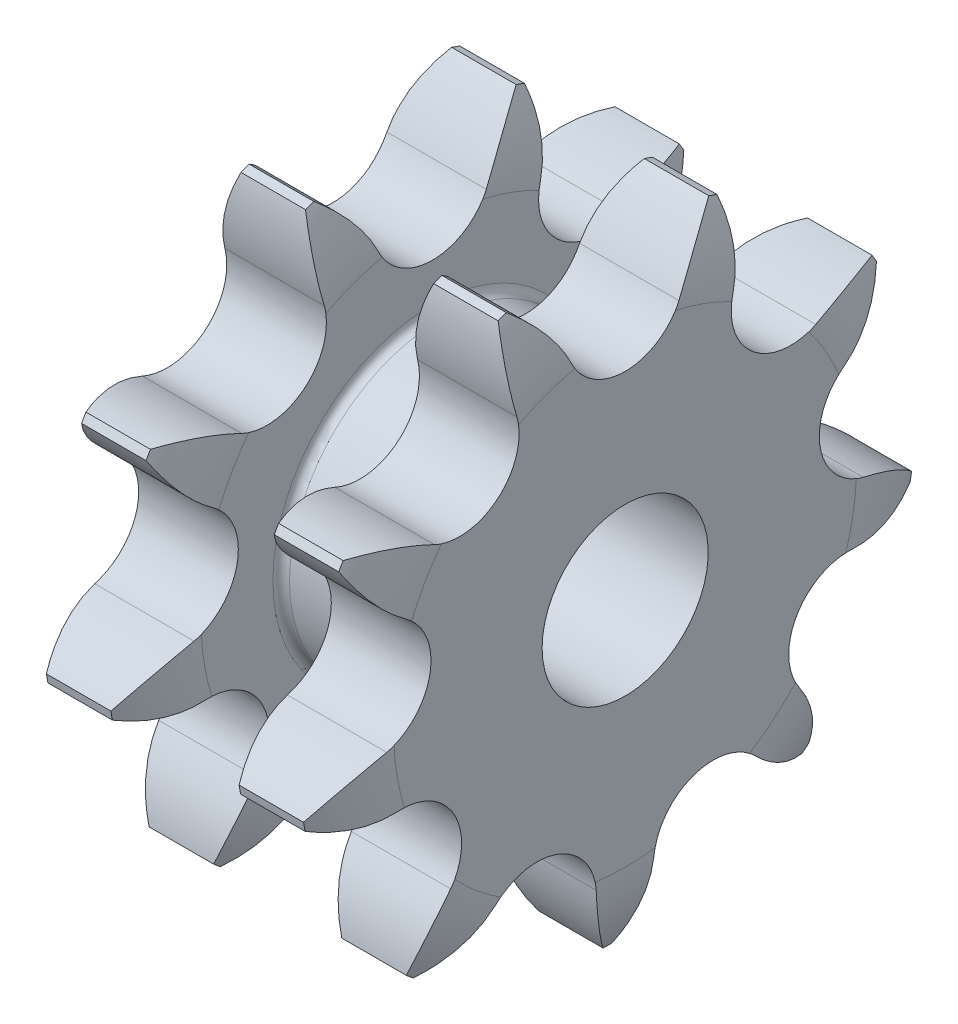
from build123d import *

# Parameters (mm, degrees)
TOOTHCUT_DEPTH  = 38.895381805
TEETHCUTS_COUNT = 9
TEETHCUTS_ANGLE = 320
BORSKE_R        = 6
BORE_DEPTH      = 23.3205


with BuildPart() as part:
    # BasProSke → Base-Revolve (revolve)
    with BuildSketch(Plane(origin=(0, 0, 0), x_dir=(1, 0, 0), z_dir=(0, 1, 0)), mode=Mode.PRIVATE) as base_revolve_sk:
        with BuildLine():
            Line((0, 0), (0, 16.712856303))
            ThreePointArc((0, 16.712856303), (0.321571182, 19.552662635), (1.27, 22.248657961))
            Line((1.27, 22.248657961), (19.85, 22.248657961))
            ThreePointArc((19.85, 22.248657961), (20.798428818, 19.552662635), (21.12, 16.712856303))
            Line((21.12, 16.712856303), (21.12, 0))
            Line((21.12, 0), (0, 0))
        make_face()
    revolve(base_revolve_sk.sketch.rotate(Axis((-10, 0, 0), (1, 0, 0)), 180), axis=Axis((-10, 0, 0), (1, 0, 0)))

    # GrvSke → Groove (revolve, cut)
    with BuildSketch(Plane(origin=(0, 0, 0), x_dir=(1, 0, 0), z_dir=(0, 1, 0)), mode=Mode.PRIVATE) as groove_sk:
        with BuildLine():
            Line((7.2, 16.712856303), (7.2, 11.530481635))
            ThreePointArc((7.2, 11.530481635), (7.375735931, 11.106217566), (7.8, 10.930481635))
            Line((7.8, 10.930481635), (13.32, 10.930481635))
            ThreePointArc((13.32, 10.930481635), (13.744264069, 11.106217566), (13.92, 11.530481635))
            Line((13.92, 11.530481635), (13.92, 16.712856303))
            ThreePointArc((13.92, 16.712856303), (14.241571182, 19.552662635), (15.19, 22.248657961))
            Line((15.19, 22.248657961), (5.93, 22.248657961))
            ThreePointArc((5.93, 22.248657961), (6.878428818, 19.552662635), (7.2, 16.712856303))
        make_face()
    revolve(groove_sk.sketch.rotate(Axis((0, 0, 0), (1, 0, 0)), 180), axis=Axis((0, 0, 0), (1, 0, 0)), mode=Mode.SUBTRACT)

    # TooCutSke → ToothCut (cut, through all)
    with BuildSketch(Plane(origin=(0, 0, 0), x_dir=(0, 0, -1), z_dir=(1, 0, 0))):
        with BuildLine():
            ThreePointArc((3.89490303, 16.792484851), (5.53909395, 19.346647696), (7.807509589, 21.366895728))
            ThreePointArc((7.807509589, 21.366895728), (0, 22.748657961), (-7.807509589, 21.366895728))
            ThreePointArc((-7.807509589, 21.366895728), (-5.53909395, 19.346647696), (-3.89490303, 16.792484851))
            ThreePointArc((-3.89490303, 16.792484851), (0, 14.311157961), (3.89490303, 16.792484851))
        make_face()
    toothcut = extrude(amount=TOOTHCUT_DEPTH, mode=Mode.SUBTRACT)

    # TeethCuts: ToothCut ×9 about axis
    teethcuts_axis = Axis((-10, 0, 0), (1, 0, 0))
    for i in range(1, TEETHCUTS_COUNT):
        add(toothcut.rotate(teethcuts_axis, i * TEETHCUTS_ANGLE / (TEETHCUTS_COUNT - 1)), mode=Mode.SUBTRACT)

    # BorSke → Bore (cut, symmetric)
    with BuildSketch(Plane(origin=(0, 0, 0), x_dir=(0, 0, -1), z_dir=(1, 0, 0))):
        with Locations(Location((0, 0, 0), (0, 0, 180))):
            Circle(BORSKE_R)
    extrude(amount=BORE_DEPTH, both=True, mode=Mode.SUBTRACT)


solid = part.part
